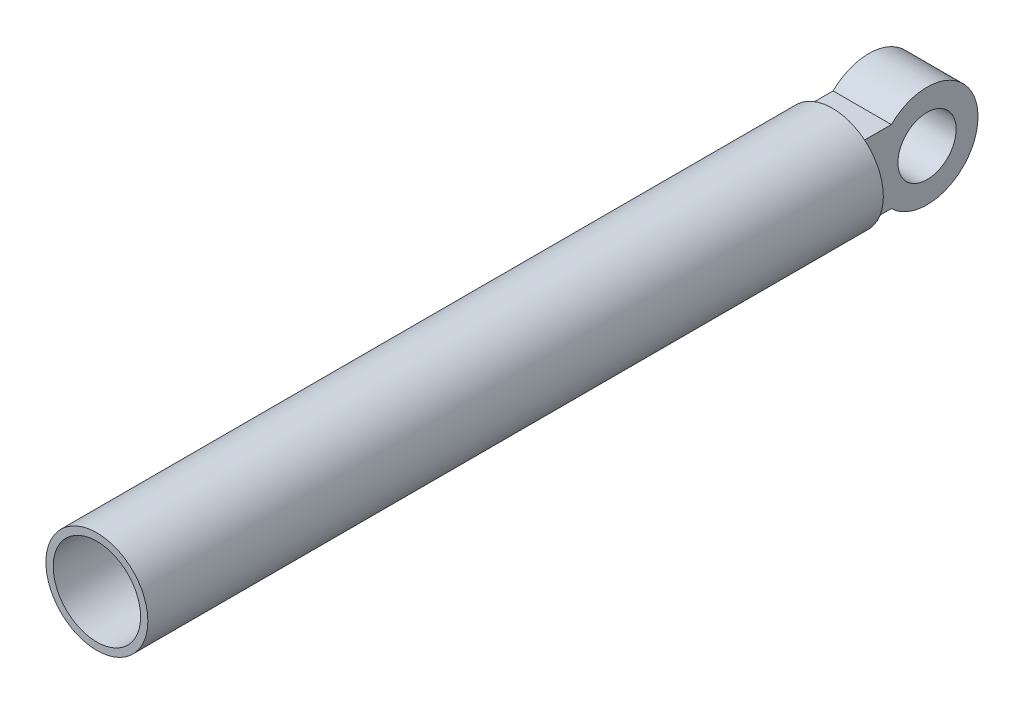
from build123d import *

# Parameters (mm, degrees)
SZKIC1_R                    = 30
DODANIE_WYCI_GNI_CIE1_DEPTH = 500
SKORUPA1_T                  = 5
SZKIC2_R                    = 20
DODANIE_WYCI_GNI_CIE2_DEPTH = 20


with BuildPart() as part:
    # Szkic1 → Dodanie-wyci_gni_cie1 (new body)
    with BuildSketch(Plane.XY):
        Circle(SZKIC1_R)
    extrude(amount=DODANIE_WYCI_GNI_CIE1_DEPTH)

    # Skorupa1
    skorupa1_openings = [part.faces().sort_by_distance(p)[0] for p in [
        (0, 0, 500),
    ]]
    offset(amount=SKORUPA1_T, openings=skorupa1_openings, kind=Kind.INTERSECTION)

    # Szkic2 → Dodanie-wyci_gni_cie2 (add, symmetric)
    with BuildSketch(Plane(origin=(0, 0, 0), x_dir=(0, 0, -1), z_dir=(1, 0, 0))):
        with BuildLine():
            Line((5, 25), (25.505102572, 25))
            ThreePointArc((25.505102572, 25), (85, 0), (25.505102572, -25))
            Line((25.505102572, -25), (5, -25))
            Line((5, -25), (5, 25))
        make_face()
        with Locations((50, 0)):
            Circle(SZKIC2_R, mode=Mode.SUBTRACT)
    extrude(amount=DODANIE_WYCI_GNI_CIE2_DEPTH, both=True)


solid = part.part
